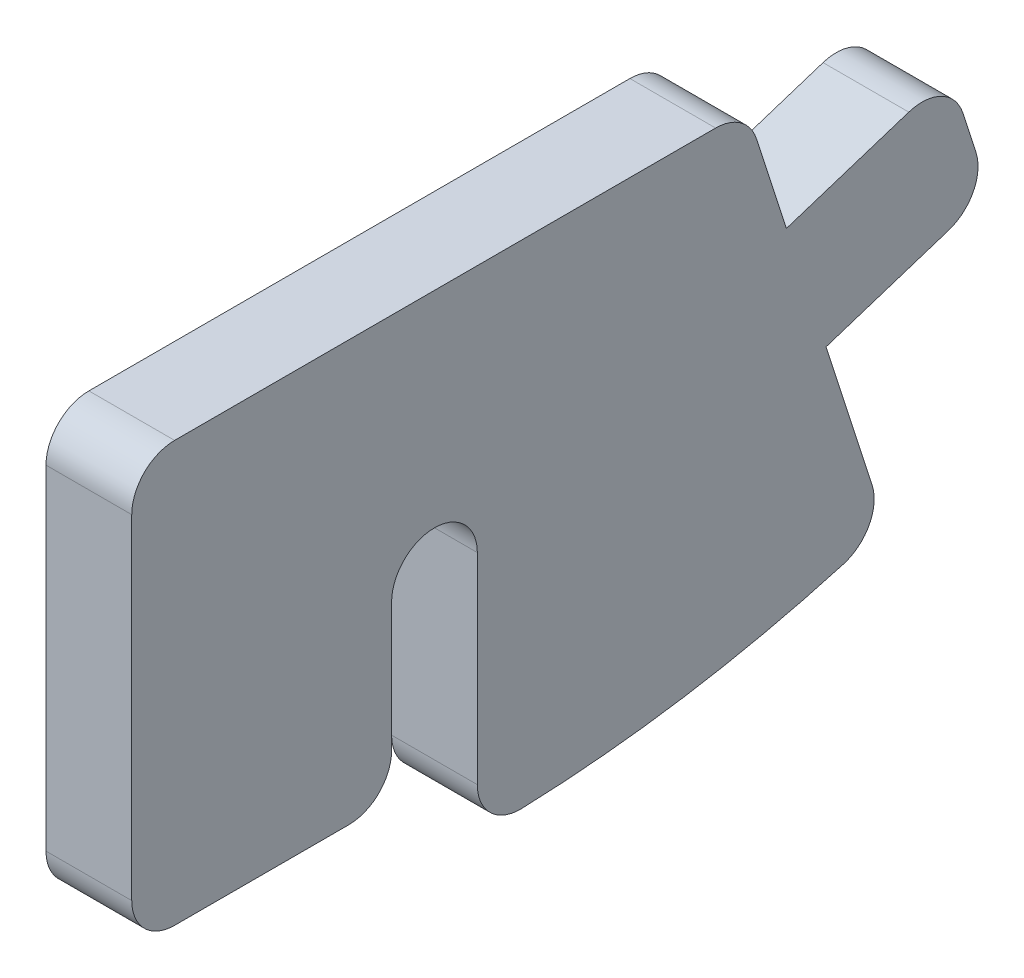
ISO-10303-21;
HEADER;
FILE_DESCRIPTION(('STEP AP214'),'2;1');
FILE_NAME('part.step','',(''),(''),'','','');
FILE_SCHEMA(('AUTOMOTIVE_DESIGN { 1 0 10303 214 1 1 1 1 }'));
ENDSEC;
DATA;
#1=APPLICATION_CONTEXT('core data for automotive mechanical design processes');
#2=APPLICATION_PROTOCOL_DEFINITION('international standard','automotive_design',2000,#1);
#3=PRODUCT_CONTEXT('',#1,'mechanical');
#4=PRODUCT('Part','Part','',(#3));
#5=PRODUCT_RELATED_PRODUCT_CATEGORY('part','',(#4));
#6=PRODUCT_DEFINITION_FORMATION('','',#4);
#7=PRODUCT_DEFINITION_CONTEXT('part definition',#1,'design');
#8=PRODUCT_DEFINITION('design','',#6,#7);
#9=PRODUCT_DEFINITION_SHAPE('','',#8);
#10=(LENGTH_UNIT() NAMED_UNIT(*) SI_UNIT(.MILLI.,.METRE.));
#11=(NAMED_UNIT(*) PLANE_ANGLE_UNIT() SI_UNIT($,.RADIAN.));
#12=(NAMED_UNIT(*) SI_UNIT($,.STERADIAN.) SOLID_ANGLE_UNIT());
#13=UNCERTAINTY_MEASURE_WITH_UNIT(LENGTH_MEASURE(1.E-05),#10,'distance_accuracy_value','');
#14=(GEOMETRIC_REPRESENTATION_CONTEXT(3) GLOBAL_UNCERTAINTY_ASSIGNED_CONTEXT((#13)) GLOBAL_UNIT_ASSIGNED_CONTEXT((#10,
#11,#12)) REPRESENTATION_CONTEXT('',''));
#15=CARTESIAN_POINT('',(0.,0.,0.));
#16=DIRECTION('',(0.,0.,1.));
#17=DIRECTION('',(1.,0.,0.));
#18=AXIS2_PLACEMENT_3D('',#15,#16,#17);
#19=CARTESIAN_POINT('',(2.,-2.85437309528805,-15.2708305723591));
#20=DIRECTION('',(0.,-0.951457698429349,-0.307779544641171));
#21=DIRECTION('',(0.,0.307779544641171,-0.951457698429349));
#22=AXIS2_PLACEMENT_3D('',#19,#20,#21);
#23=PLANE('',#22);
#24=DIRECTION('',(0.,-0.307779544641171,0.951457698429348));
#25=VECTOR('',#24,1.);
#26=CARTESIAN_POINT('',(0.,-2.85437309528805,-15.2708305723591));
#27=LINE('',#26,#25);
#28=CARTESIAN_POINT('',(0.,-1.93103446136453,-18.1252036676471));
#29=VERTEX_POINT('',#28);
#30=CARTESIAN_POINT('',(0.,-2.85437309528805,-15.2708305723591));
#31=VERTEX_POINT('',#30);
#32=EDGE_CURVE('E200',#29,#31,#27,.T.);
#33=ORIENTED_EDGE('',*,*,#32,.T.);
#34=DIRECTION('',(-1.,0.,0.));
#35=VECTOR('',#34,1.);
#36=CARTESIAN_POINT('',(2.,-2.85437309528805,-15.2708305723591));
#37=LINE('',#36,#35);
#38=CARTESIAN_POINT('',(2.,-2.85437309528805,-15.2708305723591));
#39=VERTEX_POINT('',#38);
#40=EDGE_CURVE('E11',#39,#31,#37,.T.);
#41=ORIENTED_EDGE('',*,*,#40,.F.);
#42=DIRECTION('',(0.,-0.307779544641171,0.951457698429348));
#43=VECTOR('',#42,1.);
#44=CARTESIAN_POINT('',(2.,-2.85437309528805,-15.2708305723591));
#45=LINE('',#44,#43);
#46=CARTESIAN_POINT('',(2.,-1.93103446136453,-18.1252036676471));
#47=VERTEX_POINT('',#46);
#48=EDGE_CURVE('E238',#47,#39,#45,.T.);
#49=ORIENTED_EDGE('',*,*,#48,.F.);
#50=DIRECTION('',(-1.,0.,0.));
#51=VECTOR('',#50,1.);
#52=CARTESIAN_POINT('',(2.,-1.93103446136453,-18.1252036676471));
#53=LINE('',#52,#51);
#54=EDGE_CURVE('E196',#47,#29,#53,.T.);
#55=ORIENTED_EDGE('',*,*,#54,.T.);
#56=EDGE_LOOP('',(#33,#41,#49,#55));
#57=FACE_BOUND('',#56,.T.);
#58=ADVANCED_FACE('F32',(#57),#23,.F.);
#59=CARTESIAN_POINT('',(2.,-0.692220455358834,-14.5714128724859));
#60=DIRECTION('',(0.,-0.307779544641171,0.951457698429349));
#61=DIRECTION('',(0.,-0.951457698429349,-0.307779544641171));
#62=AXIS2_PLACEMENT_3D('',#59,#60,#61);
#63=PLANE('',#62);
#64=DIRECTION('',(0.,0.951457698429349,0.307779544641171));
#65=VECTOR('',#64,1.);
#66=CARTESIAN_POINT('',(0.,-0.692220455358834,-14.5714128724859));
#67=LINE('',#66,#65);
#68=CARTESIAN_POINT('',(0.,-0.692220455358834,-14.5714128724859));
#69=VERTEX_POINT('',#68);
#70=EDGE_CURVE('E203',#31,#69,#67,.T.);
#71=ORIENTED_EDGE('',*,*,#70,.T.);
#72=DIRECTION('',(-1.,0.,0.));
#73=VECTOR('',#72,1.);
#74=CARTESIAN_POINT('',(2.,-0.692220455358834,-14.5714128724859));
#75=LINE('',#74,#73);
#76=CARTESIAN_POINT('',(2.,-0.692220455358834,-14.5714128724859));
#77=VERTEX_POINT('',#76);
#78=EDGE_CURVE('E40',#77,#69,#75,.T.);
#79=ORIENTED_EDGE('',*,*,#78,.F.);
#80=DIRECTION('',(0.,0.951457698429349,0.307779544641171));
#81=VECTOR('',#80,1.);
#82=CARTESIAN_POINT('',(2.,-0.692220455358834,-14.5714128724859));
#83=LINE('',#82,#81);
#84=EDGE_CURVE('E127',#39,#77,#83,.T.);
#85=ORIENTED_EDGE('',*,*,#84,.F.);
#86=ORIENTED_EDGE('',*,*,#40,.T.);
#87=EDGE_LOOP('',(#71,#79,#85,#86));
#88=FACE_BOUND('',#87,.T.);
#89=ADVANCED_FACE('F356',(#88),#63,.F.);
#90=CARTESIAN_POINT('',(2.,-1.,-13.6199551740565));
#91=DIRECTION('',(-1.,0.,0.));
#92=DIRECTION('',(0.,0.,1.));
#93=AXIS2_PLACEMENT_3D('',#90,#91,#92);
#94=CYLINDRICAL_SURFACE('',#93,1.);
#95=CARTESIAN_POINT('',(0.,-1.,-13.6199551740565));
#96=DIRECTION('',(1.,0.,0.));
#97=DIRECTION('',(0.,0.,1.));
#98=AXIS2_PLACEMENT_3D('',#95,#96,#97);
#99=CIRCLE('',#98,1.);
#100=CARTESIAN_POINT('',(0.,0.,-13.6199551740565));
#101=VERTEX_POINT('',#100);
#102=EDGE_CURVE('E205',#69,#101,#99,.T.);
#103=ORIENTED_EDGE('',*,*,#102,.T.);
#104=DIRECTION('',(-1.,0.,0.));
#105=VECTOR('',#104,1.);
#106=CARTESIAN_POINT('',(2.,0.,-13.6199551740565));
#107=LINE('',#106,#105);
#108=CARTESIAN_POINT('',(2.,0.,-13.6199551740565));
#109=VERTEX_POINT('',#108);
#110=EDGE_CURVE('E281',#109,#101,#107,.T.);
#111=ORIENTED_EDGE('',*,*,#110,.F.);
#112=CARTESIAN_POINT('',(2.,-1.,-13.6199551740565));
#113=DIRECTION('',(1.,0.,0.));
#114=DIRECTION('',(0.,0.,1.));
#115=AXIS2_PLACEMENT_3D('',#112,#113,#114);
#116=CIRCLE('',#115,1.);
#117=EDGE_CURVE('E289',#77,#109,#116,.T.);
#118=ORIENTED_EDGE('',*,*,#117,.F.);
#119=ORIENTED_EDGE('',*,*,#78,.T.);
#120=EDGE_LOOP('',(#103,#111,#118,#119));
#121=FACE_BOUND('',#120,.T.);
#122=ADVANCED_FACE('F287',(#121),#94,.T.);
#123=CARTESIAN_POINT('',(2.,0.,-1.00000000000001));
#124=DIRECTION('',(0.,-1.,0.));
#125=DIRECTION('',(0.,0.,-1.));
#126=AXIS2_PLACEMENT_3D('',#123,#124,#125);
#127=PLANE('',#126);
#128=DIRECTION('',(0.,0.,1.));
#129=VECTOR('',#128,1.);
#130=CARTESIAN_POINT('',(0.,0.,-1.00000000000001));
#131=LINE('',#130,#129);
#132=CARTESIAN_POINT('',(0.,0.,-1.00000000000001));
#133=VERTEX_POINT('',#132);
#134=EDGE_CURVE('E207',#101,#133,#131,.T.);
#135=ORIENTED_EDGE('',*,*,#134,.T.);
#136=DIRECTION('',(-1.,0.,0.));
#137=VECTOR('',#136,1.);
#138=CARTESIAN_POINT('',(2.,0.,-1.00000000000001));
#139=LINE('',#138,#137);
#140=CARTESIAN_POINT('',(2.,0.,-1.00000000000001));
#141=VERTEX_POINT('',#140);
#142=EDGE_CURVE('E278',#141,#133,#139,.T.);
#143=ORIENTED_EDGE('',*,*,#142,.F.);
#144=DIRECTION('',(0.,0.,1.));
#145=VECTOR('',#144,1.);
#146=CARTESIAN_POINT('',(2.,0.,-1.00000000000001));
#147=LINE('',#146,#145);
#148=EDGE_CURVE('E307',#109,#141,#147,.T.);
#149=ORIENTED_EDGE('',*,*,#148,.F.);
#150=ORIENTED_EDGE('',*,*,#110,.T.);
#151=EDGE_LOOP('',(#135,#143,#149,#150));
#152=FACE_BOUND('',#151,.T.);
#153=ADVANCED_FACE('F298',(#152),#127,.F.);
#154=CARTESIAN_POINT('',(2.,-1.,-1.));
#155=DIRECTION('',(-1.,0.,0.));
#156=DIRECTION('',(0.,0.,1.));
#157=AXIS2_PLACEMENT_3D('',#154,#155,#156);
#158=CYLINDRICAL_SURFACE('',#157,1.);
#159=CARTESIAN_POINT('',(0.,-1.,-1.));
#160=DIRECTION('',(1.,0.,0.));
#161=DIRECTION('',(0.,0.,-1.));
#162=AXIS2_PLACEMENT_3D('',#159,#160,#161);
#163=CIRCLE('',#162,1.);
#164=CARTESIAN_POINT('',(0.,-1.00000000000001,0.));
#165=VERTEX_POINT('',#164);
#166=EDGE_CURVE('E209',#133,#165,#163,.T.);
#167=ORIENTED_EDGE('',*,*,#166,.T.);
#168=DIRECTION('',(-1.,0.,0.));
#169=VECTOR('',#168,1.);
#170=CARTESIAN_POINT('',(2.,-1.00000000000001,0.));
#171=LINE('',#170,#169);
#172=CARTESIAN_POINT('',(2.,-1.00000000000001,0.));
#173=VERTEX_POINT('',#172);
#174=EDGE_CURVE('E275',#173,#165,#171,.T.);
#175=ORIENTED_EDGE('',*,*,#174,.F.);
#176=CARTESIAN_POINT('',(2.,-1.,-1.));
#177=DIRECTION('',(1.,0.,0.));
#178=DIRECTION('',(0.,0.,-1.));
#179=AXIS2_PLACEMENT_3D('',#176,#177,#178);
#180=CIRCLE('',#179,1.);
#181=EDGE_CURVE('E304',#141,#173,#180,.T.);
#182=ORIENTED_EDGE('',*,*,#181,.F.);
#183=ORIENTED_EDGE('',*,*,#142,.T.);
#184=EDGE_LOOP('',(#167,#175,#182,#183));
#185=FACE_BOUND('',#184,.T.);
#186=ADVANCED_FACE('F302',(#185),#158,.T.);
#187=CARTESIAN_POINT('',(2.,-8.79672436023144,0.));
#188=DIRECTION('',(0.,0.,-1.));
#189=DIRECTION('',(0.,1.,0.));
#190=AXIS2_PLACEMENT_3D('',#187,#188,#189);
#191=PLANE('',#190);
#192=DIRECTION('',(0.,-1.,0.));
#193=VECTOR('',#192,1.);
#194=CARTESIAN_POINT('',(0.,-8.79672436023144,0.));
#195=LINE('',#194,#193);
#196=CARTESIAN_POINT('',(0.,-8.79672436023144,0.));
#197=VERTEX_POINT('',#196);
#198=EDGE_CURVE('E211',#165,#197,#195,.T.);
#199=ORIENTED_EDGE('',*,*,#198,.T.);
#200=DIRECTION('',(-1.,0.,0.));
#201=VECTOR('',#200,1.);
#202=CARTESIAN_POINT('',(2.,-8.79672436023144,0.));
#203=LINE('',#202,#201);
#204=CARTESIAN_POINT('',(2.,-8.79672436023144,0.));
#205=VERTEX_POINT('',#204);
#206=EDGE_CURVE('E272',#205,#197,#203,.T.);
#207=ORIENTED_EDGE('',*,*,#206,.F.);
#208=DIRECTION('',(0.,-1.,0.));
#209=VECTOR('',#208,1.);
#210=CARTESIAN_POINT('',(2.,-8.79672436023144,0.));
#211=LINE('',#210,#209);
#212=EDGE_CURVE('E306',#173,#205,#211,.T.);
#213=ORIENTED_EDGE('',*,*,#212,.F.);
#214=ORIENTED_EDGE('',*,*,#174,.T.);
#215=EDGE_LOOP('',(#199,#207,#213,#214));
#216=FACE_BOUND('',#215,.T.);
#217=ADVANCED_FACE('F369',(#216),#191,.F.);
#218=CARTESIAN_POINT('',(2.,-8.79672436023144,-1.));
#219=DIRECTION('',(-1.,0.,0.));
#220=DIRECTION('',(0.,0.,1.));
#221=AXIS2_PLACEMENT_3D('',#218,#219,#220);
#222=CYLINDRICAL_SURFACE('',#221,1.);
#223=CARTESIAN_POINT('',(0.,-8.79672436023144,-1.));
#224=DIRECTION('',(1.,0.,0.));
#225=DIRECTION('',(0.,0.,1.));
#226=AXIS2_PLACEMENT_3D('',#223,#224,#225);
#227=CIRCLE('',#226,1.);
#228=CARTESIAN_POINT('',(0.,-9.79672436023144,-1.00000000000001));
#229=VERTEX_POINT('',#228);
#230=EDGE_CURVE('E213',#197,#229,#227,.T.);
#231=ORIENTED_EDGE('',*,*,#230,.T.);
#232=DIRECTION('',(-1.,0.,0.));
#233=VECTOR('',#232,1.);
#234=CARTESIAN_POINT('',(2.,-9.79672436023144,-1.00000000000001));
#235=LINE('',#234,#233);
#236=CARTESIAN_POINT('',(2.,-9.79672436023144,-1.00000000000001));
#237=VERTEX_POINT('',#236);
#238=EDGE_CURVE('E269',#237,#229,#235,.T.);
#239=ORIENTED_EDGE('',*,*,#238,.F.);
#240=CARTESIAN_POINT('',(2.,-8.79672436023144,-1.));
#241=DIRECTION('',(1.,0.,0.));
#242=DIRECTION('',(0.,0.,1.));
#243=AXIS2_PLACEMENT_3D('',#240,#241,#242);
#244=CIRCLE('',#243,1.);
#245=EDGE_CURVE('E309',#205,#237,#244,.T.);
#246=ORIENTED_EDGE('',*,*,#245,.F.);
#247=ORIENTED_EDGE('',*,*,#206,.T.);
#248=EDGE_LOOP('',(#231,#239,#246,#247));
#249=FACE_BOUND('',#248,.T.);
#250=ADVANCED_FACE('F372',(#249),#222,.T.);
#251=CARTESIAN_POINT('',(2.,-9.79672436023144,-5.0613182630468));
#252=DIRECTION('',(0.,1.,0.));
#253=DIRECTION('',(0.,0.,1.));
#254=AXIS2_PLACEMENT_3D('',#251,#252,#253);
#255=PLANE('',#254);
#256=DIRECTION('',(0.,0.,-1.));
#257=VECTOR('',#256,1.);
#258=CARTESIAN_POINT('',(0.,-9.79672436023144,-5.0613182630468));
#259=LINE('',#258,#257);
#260=CARTESIAN_POINT('',(0.,-9.79672436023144,-5.0613182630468));
#261=VERTEX_POINT('',#260);
#262=EDGE_CURVE('E215',#229,#261,#259,.T.);
#263=ORIENTED_EDGE('',*,*,#262,.T.);
#264=DIRECTION('',(-1.,0.,0.));
#265=VECTOR('',#264,1.);
#266=CARTESIAN_POINT('',(2.,-9.79672436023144,-5.0613182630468));
#267=LINE('',#266,#265);
#268=CARTESIAN_POINT('',(2.,-9.79672436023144,-5.0613182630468));
#269=VERTEX_POINT('',#268);
#270=EDGE_CURVE('E266',#269,#261,#267,.T.);
#271=ORIENTED_EDGE('',*,*,#270,.F.);
#272=DIRECTION('',(0.,0.,-1.));
#273=VECTOR('',#272,1.);
#274=CARTESIAN_POINT('',(2.,-9.79672436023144,-5.0613182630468));
#275=LINE('',#274,#273);
#276=EDGE_CURVE('E315',#237,#269,#275,.T.);
#277=ORIENTED_EDGE('',*,*,#276,.F.);
#278=ORIENTED_EDGE('',*,*,#238,.T.);
#279=EDGE_LOOP('',(#263,#271,#277,#278));
#280=FACE_BOUND('',#279,.T.);
#281=ADVANCED_FACE('F376',(#280),#255,.F.);
#282=CARTESIAN_POINT('',(2.,-8.79672436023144,-5.06131826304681));
#283=DIRECTION('',(-1.,0.,0.));
#284=DIRECTION('',(0.,0.,1.));
#285=AXIS2_PLACEMENT_3D('',#282,#283,#284);
#286=CYLINDRICAL_SURFACE('',#285,1.);
#287=CARTESIAN_POINT('',(0.,-8.79672436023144,-5.06131826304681));
#288=DIRECTION('',(1.,0.,0.));
#289=DIRECTION('',(0.,0.,1.));
#290=AXIS2_PLACEMENT_3D('',#287,#288,#289);
#291=CIRCLE('',#290,1.);
#292=CARTESIAN_POINT('',(0.,-8.79672436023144,-6.06131826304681));
#293=VERTEX_POINT('',#292);
#294=EDGE_CURVE('E217',#261,#293,#291,.T.);
#295=ORIENTED_EDGE('',*,*,#294,.T.);
#296=DIRECTION('',(-1.,0.,0.));
#297=VECTOR('',#296,1.);
#298=CARTESIAN_POINT('',(2.,-8.79672436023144,-6.06131826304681));
#299=LINE('',#298,#297);
#300=CARTESIAN_POINT('',(2.,-8.79672436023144,-6.06131826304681));
#301=VERTEX_POINT('',#300);
#302=EDGE_CURVE('E263',#301,#293,#299,.T.);
#303=ORIENTED_EDGE('',*,*,#302,.F.);
#304=CARTESIAN_POINT('',(2.,-8.79672436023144,-5.06131826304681));
#305=DIRECTION('',(1.,0.,0.));
#306=DIRECTION('',(0.,0.,1.));
#307=AXIS2_PLACEMENT_3D('',#304,#305,#306);
#308=CIRCLE('',#307,1.);
#309=EDGE_CURVE('E317',#269,#301,#308,.T.);
#310=ORIENTED_EDGE('',*,*,#309,.F.);
#311=ORIENTED_EDGE('',*,*,#270,.T.);
#312=EDGE_LOOP('',(#295,#303,#310,#311));
#313=FACE_BOUND('',#312,.T.);
#314=ADVANCED_FACE('F380',(#313),#286,.T.);
#315=CARTESIAN_POINT('',(2.,-5.79672436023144,-6.06131826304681));
#316=DIRECTION('',(0.,0.,1.));
#317=DIRECTION('',(0.,-1.,0.));
#318=AXIS2_PLACEMENT_3D('',#315,#316,#317);
#319=PLANE('',#318);
#320=DIRECTION('',(0.,1.,0.));
#321=VECTOR('',#320,1.);
#322=CARTESIAN_POINT('',(0.,-5.79672436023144,-6.06131826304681));
#323=LINE('',#322,#321);
#324=CARTESIAN_POINT('',(0.,-5.79672436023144,-6.06131826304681));
#325=VERTEX_POINT('',#324);
#326=EDGE_CURVE('E219',#293,#325,#323,.T.);
#327=ORIENTED_EDGE('',*,*,#326,.T.);
#328=DIRECTION('',(-1.,0.,0.));
#329=VECTOR('',#328,1.);
#330=CARTESIAN_POINT('',(2.,-5.79672436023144,-6.06131826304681));
#331=LINE('',#330,#329);
#332=CARTESIAN_POINT('',(2.,-5.79672436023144,-6.06131826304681));
#333=VERTEX_POINT('',#332);
#334=EDGE_CURVE('E260',#333,#325,#331,.T.);
#335=ORIENTED_EDGE('',*,*,#334,.F.);
#336=DIRECTION('',(0.,1.,0.));
#337=VECTOR('',#336,1.);
#338=CARTESIAN_POINT('',(2.,-5.79672436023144,-6.06131826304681));
#339=LINE('',#338,#337);
#340=EDGE_CURVE('E319',#301,#333,#339,.T.);
#341=ORIENTED_EDGE('',*,*,#340,.F.);
#342=ORIENTED_EDGE('',*,*,#302,.T.);
#343=EDGE_LOOP('',(#327,#335,#341,#342));
#344=FACE_BOUND('',#343,.T.);
#345=ADVANCED_FACE('F384',(#344),#319,.F.);
#346=CARTESIAN_POINT('',(2.,-5.79672436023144,-7.06131826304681));
#347=DIRECTION('',(-1.,0.,0.));
#348=DIRECTION('',(0.,0.,1.));
#349=AXIS2_PLACEMENT_3D('',#346,#347,#348);
#350=CYLINDRICAL_SURFACE('',#349,1.);
#351=CARTESIAN_POINT('',(0.,-5.79672436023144,-7.06131826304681));
#352=DIRECTION('',(-1.,0.,0.));
#353=DIRECTION('',(0.,0.,-1.));
#354=AXIS2_PLACEMENT_3D('',#351,#352,#353);
#355=CIRCLE('',#354,1.);
#356=CARTESIAN_POINT('',(0.,-5.79672436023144,-8.06131826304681));
#357=VERTEX_POINT('',#356);
#358=EDGE_CURVE('E221',#325,#357,#355,.T.);
#359=ORIENTED_EDGE('',*,*,#358,.T.);
#360=DIRECTION('',(-1.,0.,0.));
#361=VECTOR('',#360,1.);
#362=CARTESIAN_POINT('',(2.,-5.79672436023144,-8.06131826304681));
#363=LINE('',#362,#361);
#364=CARTESIAN_POINT('',(2.,-5.79672436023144,-8.06131826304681));
#365=VERTEX_POINT('',#364);
#366=EDGE_CURVE('E257',#365,#357,#363,.T.);
#367=ORIENTED_EDGE('',*,*,#366,.F.);
#368=CARTESIAN_POINT('',(2.,-5.79672436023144,-7.06131826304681));
#369=DIRECTION('',(-1.,0.,0.));
#370=DIRECTION('',(0.,0.,-1.));
#371=AXIS2_PLACEMENT_3D('',#368,#369,#370);
#372=CIRCLE('',#371,1.);
#373=EDGE_CURVE('E321',#333,#365,#372,.T.);
#374=ORIENTED_EDGE('',*,*,#373,.F.);
#375=ORIENTED_EDGE('',*,*,#334,.T.);
#376=EDGE_LOOP('',(#359,#367,#374,#375));
#377=FACE_BOUND('',#376,.T.);
#378=ADVANCED_FACE('F388',(#377),#350,.F.);
#379=CARTESIAN_POINT('',(2.,-10.4849221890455,-8.06131826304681));
#380=DIRECTION('',(0.,0.,-1.));
#381=DIRECTION('',(0.,1.,0.));
#382=AXIS2_PLACEMENT_3D('',#379,#380,#381);
#383=PLANE('',#382);
#384=DIRECTION('',(0.,-1.,0.));
#385=VECTOR('',#384,1.);
#386=CARTESIAN_POINT('',(0.,-10.4849221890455,-8.06131826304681));
#387=LINE('',#386,#385);
#388=CARTESIAN_POINT('',(0.,-10.4849221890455,-8.06131826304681));
#389=VERTEX_POINT('',#388);
#390=EDGE_CURVE('E223',#357,#389,#387,.T.);
#391=ORIENTED_EDGE('',*,*,#390,.T.);
#392=DIRECTION('',(-1.,0.,0.));
#393=VECTOR('',#392,1.);
#394=CARTESIAN_POINT('',(2.,-10.4849221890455,-8.06131826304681));
#395=LINE('',#394,#393);
#396=CARTESIAN_POINT('',(2.,-10.4849221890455,-8.06131826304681));
#397=VERTEX_POINT('',#396);
#398=EDGE_CURVE('E254',#397,#389,#395,.T.);
#399=ORIENTED_EDGE('',*,*,#398,.F.);
#400=DIRECTION('',(0.,-1.,0.));
#401=VECTOR('',#400,1.);
#402=CARTESIAN_POINT('',(2.,-10.4849221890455,-8.06131826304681));
#403=LINE('',#402,#401);
#404=EDGE_CURVE('E323',#365,#397,#403,.T.);
#405=ORIENTED_EDGE('',*,*,#404,.F.);
#406=ORIENTED_EDGE('',*,*,#366,.T.);
#407=EDGE_LOOP('',(#391,#399,#405,#406));
#408=FACE_BOUND('',#407,.T.);
#409=ADVANCED_FACE('F392',(#408),#383,.F.);
#410=CARTESIAN_POINT('',(2.,-10.4849221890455,-9.06131826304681));
#411=DIRECTION('',(-1.,0.,0.));
#412=DIRECTION('',(0.,0.,1.));
#413=AXIS2_PLACEMENT_3D('',#410,#411,#412);
#414=CYLINDRICAL_SURFACE('',#413,1.);
#415=CARTESIAN_POINT('',(0.,-10.4849221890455,-9.06131826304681));
#416=DIRECTION('',(1.,0.,0.));
#417=DIRECTION('',(0.,0.,1.));
#418=AXIS2_PLACEMENT_3D('',#415,#416,#417);
#419=CIRCLE('',#418,1.);
#420=CARTESIAN_POINT('',(0.,-11.4843640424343,-9.09472457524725));
#421=VERTEX_POINT('',#420);
#422=EDGE_CURVE('E225',#389,#421,#419,.T.);
#423=ORIENTED_EDGE('',*,*,#422,.T.);
#424=DIRECTION('',(-1.,0.,0.));
#425=VECTOR('',#424,1.);
#426=CARTESIAN_POINT('',(2.,-11.4843640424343,-9.09472457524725));
#427=LINE('',#426,#425);
#428=CARTESIAN_POINT('',(2.,-11.4843640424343,-9.09472457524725));
#429=VERTEX_POINT('',#428);
#430=EDGE_CURVE('E251',#429,#421,#427,.T.);
#431=ORIENTED_EDGE('',*,*,#430,.F.);
#432=CARTESIAN_POINT('',(2.,-10.4849221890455,-9.06131826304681));
#433=DIRECTION('',(1.,0.,0.));
#434=DIRECTION('',(0.,0.,1.));
#435=AXIS2_PLACEMENT_3D('',#432,#433,#434);
#436=CIRCLE('',#435,1.);
#437=EDGE_CURVE('E325',#397,#429,#436,.T.);
#438=ORIENTED_EDGE('',*,*,#437,.F.);
#439=ORIENTED_EDGE('',*,*,#398,.T.);
#440=EDGE_LOOP('',(#423,#431,#438,#439));
#441=FACE_BOUND('',#440,.T.);
#442=ADVANCED_FACE('F396',(#441),#414,.T.);
#443=CARTESIAN_POINT('',(2.,19.4328324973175,-8.06131826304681));
#444=DIRECTION('',(-1.,0.,0.));
#445=DIRECTION('',(0.,0.,1.));
#446=AXIS2_PLACEMENT_3D('',#443,#444,#445);
#447=CYLINDRICAL_SURFACE('',#446,30.9344625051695);
#448=CARTESIAN_POINT('',(0.,19.4328324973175,-8.06131826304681));
#449=DIRECTION('',(1.,0.,0.));
#450=DIRECTION('',(0.,0.,1.));
#451=AXIS2_PLACEMENT_3D('',#448,#449,#450);
#452=CIRCLE('',#451,30.9344625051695);
#453=CARTESIAN_POINT('',(0.,-10.3016334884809,-16.5937565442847));
#454=VERTEX_POINT('',#453);
#455=EDGE_CURVE('E227',#421,#454,#452,.T.);
#456=ORIENTED_EDGE('',*,*,#455,.T.);
#457=DIRECTION('',(-1.,0.,0.));
#458=VECTOR('',#457,1.);
#459=CARTESIAN_POINT('',(2.,-10.3016334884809,-16.5937565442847));
#460=LINE('',#459,#458);
#461=CARTESIAN_POINT('',(2.,-10.3016334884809,-16.5937565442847));
#462=VERTEX_POINT('',#461);
#463=EDGE_CURVE('E248',#462,#454,#460,.T.);
#464=ORIENTED_EDGE('',*,*,#463,.F.);
#465=CARTESIAN_POINT('',(2.,19.4328324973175,-8.06131826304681));
#466=DIRECTION('',(1.,0.,0.));
#467=DIRECTION('',(0.,0.,1.));
#468=AXIS2_PLACEMENT_3D('',#465,#466,#467);
#469=CIRCLE('',#468,30.9344625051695);
#470=EDGE_CURVE('E327',#429,#462,#469,.T.);
#471=ORIENTED_EDGE('',*,*,#470,.F.);
#472=ORIENTED_EDGE('',*,*,#430,.T.);
#473=EDGE_LOOP('',(#456,#464,#471,#472));
#474=FACE_BOUND('',#473,.T.);
#475=ADVANCED_FACE('F400',(#474),#447,.T.);
#476=CARTESIAN_POINT('',(2.,-9.34042506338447,-16.3179334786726));
#477=DIRECTION('',(-1.,0.,0.));
#478=DIRECTION('',(0.,0.,1.));
#479=AXIS2_PLACEMENT_3D('',#476,#477,#478);
#480=CYLINDRICAL_SURFACE('',#479,1.);
#481=CARTESIAN_POINT('',(0.,-9.34042506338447,-16.3179334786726));
#482=DIRECTION('',(1.,0.,0.));
#483=DIRECTION('',(0.,0.,1.));
#484=AXIS2_PLACEMENT_3D('',#481,#482,#483);
#485=CIRCLE('',#484,1.);
#486=CARTESIAN_POINT('',(0.,-9.0326455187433,-17.2693911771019));
#487=VERTEX_POINT('',#486);
#488=EDGE_CURVE('E229',#454,#487,#485,.T.);
#489=ORIENTED_EDGE('',*,*,#488,.T.);
#490=DIRECTION('',(-1.,0.,0.));
#491=VECTOR('',#490,1.);
#492=CARTESIAN_POINT('',(2.,-9.0326455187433,-17.2693911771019));
#493=LINE('',#492,#491);
#494=CARTESIAN_POINT('',(2.,-9.0326455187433,-17.2693911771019));
#495=VERTEX_POINT('',#494);
#496=EDGE_CURVE('E245',#495,#487,#493,.T.);
#497=ORIENTED_EDGE('',*,*,#496,.F.);
#498=CARTESIAN_POINT('',(2.,-9.34042506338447,-16.3179334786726));
#499=DIRECTION('',(1.,0.,0.));
#500=DIRECTION('',(0.,0.,1.));
#501=AXIS2_PLACEMENT_3D('',#498,#499,#500);
#502=CIRCLE('',#501,1.);
#503=EDGE_CURVE('E329',#462,#495,#502,.T.);
#504=ORIENTED_EDGE('',*,*,#503,.F.);
#505=ORIENTED_EDGE('',*,*,#463,.T.);
#506=EDGE_LOOP('',(#489,#497,#504,#505));
#507=FACE_BOUND('',#506,.T.);
#508=ADVANCED_FACE('F404',(#507),#480,.T.);
#509=CARTESIAN_POINT('',(2.,-5.70874619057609,-16.1941692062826));
#510=DIRECTION('',(0.,-0.307779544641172,0.951457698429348));
#511=DIRECTION('',(0.,-0.951457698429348,-0.307779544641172));
#512=AXIS2_PLACEMENT_3D('',#509,#510,#511);
#513=PLANE('',#512);
#514=DIRECTION('',(0.,0.951457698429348,0.307779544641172));
#515=VECTOR('',#514,1.);
#516=CARTESIAN_POINT('',(0.,-5.70874619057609,-16.1941692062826));
#517=LINE('',#516,#515);
#518=CARTESIAN_POINT('',(0.,-5.70874619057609,-16.1941692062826));
#519=VERTEX_POINT('',#518);
#520=EDGE_CURVE('E231',#487,#519,#517,.T.);
#521=ORIENTED_EDGE('',*,*,#520,.T.);
#522=DIRECTION('',(-1.,0.,0.));
#523=VECTOR('',#522,1.);
#524=CARTESIAN_POINT('',(2.,-5.70874619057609,-16.1941692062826));
#525=LINE('',#524,#523);
#526=CARTESIAN_POINT('',(2.,-5.70874619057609,-16.1941692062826));
#527=VERTEX_POINT('',#526);
#528=EDGE_CURVE('E242',#527,#519,#525,.T.);
#529=ORIENTED_EDGE('',*,*,#528,.F.);
#530=DIRECTION('',(0.,0.951457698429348,0.307779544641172));
#531=VECTOR('',#530,1.);
#532=CARTESIAN_POINT('',(2.,-5.70874619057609,-16.1941692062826));
#533=LINE('',#532,#531);
#534=EDGE_CURVE('E331',#495,#527,#533,.T.);
#535=ORIENTED_EDGE('',*,*,#534,.F.);
#536=ORIENTED_EDGE('',*,*,#496,.T.);
#537=EDGE_LOOP('',(#521,#529,#535,#536));
#538=FACE_BOUND('',#537,.T.);
#539=ADVANCED_FACE('F337',(#538),#513,.F.);
#540=CARTESIAN_POINT('',(2.,-4.78540755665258,-19.0485423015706));
#541=DIRECTION('',(0.,0.951457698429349,0.307779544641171));
#542=DIRECTION('',(0.,-0.307779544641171,0.951457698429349));
#543=AXIS2_PLACEMENT_3D('',#540,#541,#542);
#544=PLANE('',#543);
#545=DIRECTION('',(0.,0.307779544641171,-0.951457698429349));
#546=VECTOR('',#545,1.);
#547=CARTESIAN_POINT('',(0.,-4.78540755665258,-19.0485423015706));
#548=LINE('',#547,#546);
#549=CARTESIAN_POINT('',(0.,-4.78540755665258,-19.0485423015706));
#550=VERTEX_POINT('',#549);
#551=EDGE_CURVE('E233',#519,#550,#548,.T.);
#552=ORIENTED_EDGE('',*,*,#551,.T.);
#553=DIRECTION('',(-1.,0.,0.));
#554=VECTOR('',#553,1.);
#555=CARTESIAN_POINT('',(2.,-4.78540755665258,-19.0485423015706));
#556=LINE('',#555,#554);
#557=CARTESIAN_POINT('',(2.,-4.78540755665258,-19.0485423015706));
#558=VERTEX_POINT('',#557);
#559=EDGE_CURVE('E191',#558,#550,#556,.T.);
#560=ORIENTED_EDGE('',*,*,#559,.F.);
#561=DIRECTION('',(0.,0.307779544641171,-0.951457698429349));
#562=VECTOR('',#561,1.);
#563=CARTESIAN_POINT('',(2.,-4.78540755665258,-19.0485423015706));
#564=LINE('',#563,#562);
#565=EDGE_CURVE('E182',#527,#558,#564,.T.);
#566=ORIENTED_EDGE('',*,*,#565,.F.);
#567=ORIENTED_EDGE('',*,*,#528,.T.);
#568=EDGE_LOOP('',(#552,#560,#566,#567));
#569=FACE_BOUND('',#568,.T.);
#570=ADVANCED_FACE('F341',(#569),#544,.F.);
#571=CARTESIAN_POINT('',(2.,-3.83394985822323,-18.7407627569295));
#572=DIRECTION('',(-1.,0.,0.));
#573=DIRECTION('',(0.,0.,1.));
#574=AXIS2_PLACEMENT_3D('',#571,#572,#573);
#575=CYLINDRICAL_SURFACE('',#574,0.999999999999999);
#576=CARTESIAN_POINT('',(0.,-3.83394985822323,-18.7407627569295));
#577=DIRECTION('',(1.,0.,0.));
#578=DIRECTION('',(0.,0.,1.));
#579=AXIS2_PLACEMENT_3D('',#576,#577,#578);
#580=CIRCLE('',#579,0.999999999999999);
#581=CARTESIAN_POINT('',(0.,-3.52617031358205,-19.6922204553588));
#582=VERTEX_POINT('',#581);
#583=EDGE_CURVE('E190',#550,#582,#580,.T.);
#584=ORIENTED_EDGE('',*,*,#583,.T.);
#585=DIRECTION('',(-1.,0.,0.));
#586=VECTOR('',#585,1.);
#587=CARTESIAN_POINT('',(2.,-3.52617031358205,-19.6922204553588));
#588=LINE('',#587,#586);
#589=CARTESIAN_POINT('',(2.,-3.52617031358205,-19.6922204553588));
#590=VERTEX_POINT('',#589);
#591=EDGE_CURVE('E187',#590,#582,#588,.T.);
#592=ORIENTED_EDGE('',*,*,#591,.F.);
#593=CARTESIAN_POINT('',(2.,-3.83394985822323,-18.7407627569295));
#594=DIRECTION('',(1.,0.,0.));
#595=DIRECTION('',(0.,0.,1.));
#596=AXIS2_PLACEMENT_3D('',#593,#594,#595);
#597=CIRCLE('',#596,0.999999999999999);
#598=EDGE_CURVE('E176',#558,#590,#597,.T.);
#599=ORIENTED_EDGE('',*,*,#598,.F.);
#600=ORIENTED_EDGE('',*,*,#559,.T.);
#601=EDGE_LOOP('',(#584,#592,#599,#600));
#602=FACE_BOUND('',#601,.T.);
#603=ADVANCED_FACE('F188',(#602),#575,.T.);
#604=CARTESIAN_POINT('',(2.,-2.57471261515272,-19.3844409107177));
#605=DIRECTION('',(0.,-0.30777954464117,0.951457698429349));
#606=DIRECTION('',(0.,-0.951457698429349,-0.30777954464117));
#607=AXIS2_PLACEMENT_3D('',#604,#605,#606);
#608=PLANE('',#607);
#609=DIRECTION('',(0.,0.951457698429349,0.30777954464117));
#610=VECTOR('',#609,1.);
#611=CARTESIAN_POINT('',(0.,-2.57471261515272,-19.3844409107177));
#612=LINE('',#611,#610);
#613=CARTESIAN_POINT('',(0.,-2.57471261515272,-19.3844409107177));
#614=VERTEX_POINT('',#613);
#615=EDGE_CURVE('E113',#582,#614,#612,.T.);
#616=ORIENTED_EDGE('',*,*,#615,.T.);
#617=DIRECTION('',(-1.,0.,0.));
#618=VECTOR('',#617,1.);
#619=CARTESIAN_POINT('',(2.,-2.57471261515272,-19.3844409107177));
#620=LINE('',#619,#618);
#621=CARTESIAN_POINT('',(2.,-2.57471261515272,-19.3844409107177));
#622=VERTEX_POINT('',#621);
#623=EDGE_CURVE('E192',#622,#614,#620,.T.);
#624=ORIENTED_EDGE('',*,*,#623,.F.);
#625=DIRECTION('',(0.,0.951457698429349,0.30777954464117));
#626=VECTOR('',#625,1.);
#627=CARTESIAN_POINT('',(2.,-2.57471261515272,-19.3844409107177));
#628=LINE('',#627,#626);
#629=EDGE_CURVE('E180',#590,#622,#628,.T.);
#630=ORIENTED_EDGE('',*,*,#629,.F.);
#631=ORIENTED_EDGE('',*,*,#591,.T.);
#632=EDGE_LOOP('',(#616,#624,#630,#631));
#633=FACE_BOUND('',#632,.T.);
#634=ADVANCED_FACE('F194',(#633),#608,.F.);
#635=CARTESIAN_POINT('',(2.,-2.88249215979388,-18.4329832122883));
#636=DIRECTION('',(-1.,0.,0.));
#637=DIRECTION('',(0.,0.,1.));
#638=AXIS2_PLACEMENT_3D('',#635,#636,#637);
#639=CYLINDRICAL_SURFACE('',#638,1.);
#640=CARTESIAN_POINT('',(0.,-2.88249215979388,-18.4329832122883));
#641=DIRECTION('',(1.,0.,0.));
#642=DIRECTION('',(0.,0.,1.));
#643=AXIS2_PLACEMENT_3D('',#640,#641,#642);
#644=CIRCLE('',#643,1.);
#645=EDGE_CURVE('E119',#614,#29,#644,.T.);
#646=ORIENTED_EDGE('',*,*,#645,.T.);
#647=ORIENTED_EDGE('',*,*,#54,.F.);
#648=CARTESIAN_POINT('',(2.,-2.88249215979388,-18.4329832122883));
#649=DIRECTION('',(1.,0.,0.));
#650=DIRECTION('',(0.,0.,1.));
#651=AXIS2_PLACEMENT_3D('',#648,#649,#650);
#652=CIRCLE('',#651,1.);
#653=EDGE_CURVE('E48',#622,#47,#652,.T.);
#654=ORIENTED_EDGE('',*,*,#653,.F.);
#655=ORIENTED_EDGE('',*,*,#623,.T.);
#656=EDGE_LOOP('',(#646,#647,#654,#655));
#657=FACE_BOUND('',#656,.T.);
#658=ADVANCED_FACE('F345',(#657),#639,.T.);
#659=CARTESIAN_POINT('',(2.,-2.88249215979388,-18.4329832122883));
#660=DIRECTION('',(-1.,0.,0.));
#661=DIRECTION('',(0.,0.,1.));
#662=AXIS2_PLACEMENT_3D('',#659,#660,#661);
#663=PLANE('',#662);
#664=ORIENTED_EDGE('',*,*,#48,.T.);
#665=ORIENTED_EDGE('',*,*,#84,.T.);
#666=ORIENTED_EDGE('',*,*,#117,.T.);
#667=ORIENTED_EDGE('',*,*,#148,.T.);
#668=ORIENTED_EDGE('',*,*,#181,.T.);
#669=ORIENTED_EDGE('',*,*,#212,.T.);
#670=ORIENTED_EDGE('',*,*,#245,.T.);
#671=ORIENTED_EDGE('',*,*,#276,.T.);
#672=ORIENTED_EDGE('',*,*,#309,.T.);
#673=ORIENTED_EDGE('',*,*,#340,.T.);
#674=ORIENTED_EDGE('',*,*,#373,.T.);
#675=ORIENTED_EDGE('',*,*,#404,.T.);
#676=ORIENTED_EDGE('',*,*,#437,.T.);
#677=ORIENTED_EDGE('',*,*,#470,.T.);
#678=ORIENTED_EDGE('',*,*,#503,.T.);
#679=ORIENTED_EDGE('',*,*,#534,.T.);
#680=ORIENTED_EDGE('',*,*,#565,.T.);
#681=ORIENTED_EDGE('',*,*,#598,.T.);
#682=ORIENTED_EDGE('',*,*,#629,.T.);
#683=ORIENTED_EDGE('',*,*,#653,.T.);
#684=EDGE_LOOP('',(#664,#665,#666,#667,#668,#669,#670,#671,#672,#673,#674,#675,#676,#677,#678,
#679,#680,#681,#682,#683));
#685=FACE_BOUND('',#684,.T.);
#686=ADVANCED_FACE('F178',(#685),#663,.F.);
#687=CARTESIAN_POINT('',(0.,-2.88249215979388,-18.4329832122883));
#688=DIRECTION('',(-1.,0.,0.));
#689=DIRECTION('',(0.,0.,1.));
#690=AXIS2_PLACEMENT_3D('',#687,#688,#689);
#691=PLANE('',#690);
#692=ORIENTED_EDGE('',*,*,#32,.F.);
#693=ORIENTED_EDGE('',*,*,#645,.F.);
#694=ORIENTED_EDGE('',*,*,#615,.F.);
#695=ORIENTED_EDGE('',*,*,#583,.F.);
#696=ORIENTED_EDGE('',*,*,#551,.F.);
#697=ORIENTED_EDGE('',*,*,#520,.F.);
#698=ORIENTED_EDGE('',*,*,#488,.F.);
#699=ORIENTED_EDGE('',*,*,#455,.F.);
#700=ORIENTED_EDGE('',*,*,#422,.F.);
#701=ORIENTED_EDGE('',*,*,#390,.F.);
#702=ORIENTED_EDGE('',*,*,#358,.F.);
#703=ORIENTED_EDGE('',*,*,#326,.F.);
#704=ORIENTED_EDGE('',*,*,#294,.F.);
#705=ORIENTED_EDGE('',*,*,#262,.F.);
#706=ORIENTED_EDGE('',*,*,#230,.F.);
#707=ORIENTED_EDGE('',*,*,#198,.F.);
#708=ORIENTED_EDGE('',*,*,#166,.F.);
#709=ORIENTED_EDGE('',*,*,#134,.F.);
#710=ORIENTED_EDGE('',*,*,#102,.F.);
#711=ORIENTED_EDGE('',*,*,#70,.F.);
#712=EDGE_LOOP('',(#692,#693,#694,#695,#696,#697,#698,#699,#700,#701,#702,#703,#704,#705,#706,
#707,#708,#709,#710,#711));
#713=FACE_BOUND('',#712,.T.);
#714=ADVANCED_FACE('F293',(#713),#691,.T.);
#715=CLOSED_SHELL('',(#58,#89,#122,#153,#186,#217,#250,#281,#314,#345,#378,#409,#442,#475,#508,
#539,#570,#603,#634,#658,#686,#714));
#716=MANIFOLD_SOLID_BREP('B2',#715);
#717=ADVANCED_BREP_SHAPE_REPRESENTATION('',(#18,#716),#14);
#718=SHAPE_DEFINITION_REPRESENTATION(#9,#717);
ENDSEC;
END-ISO-10303-21;
